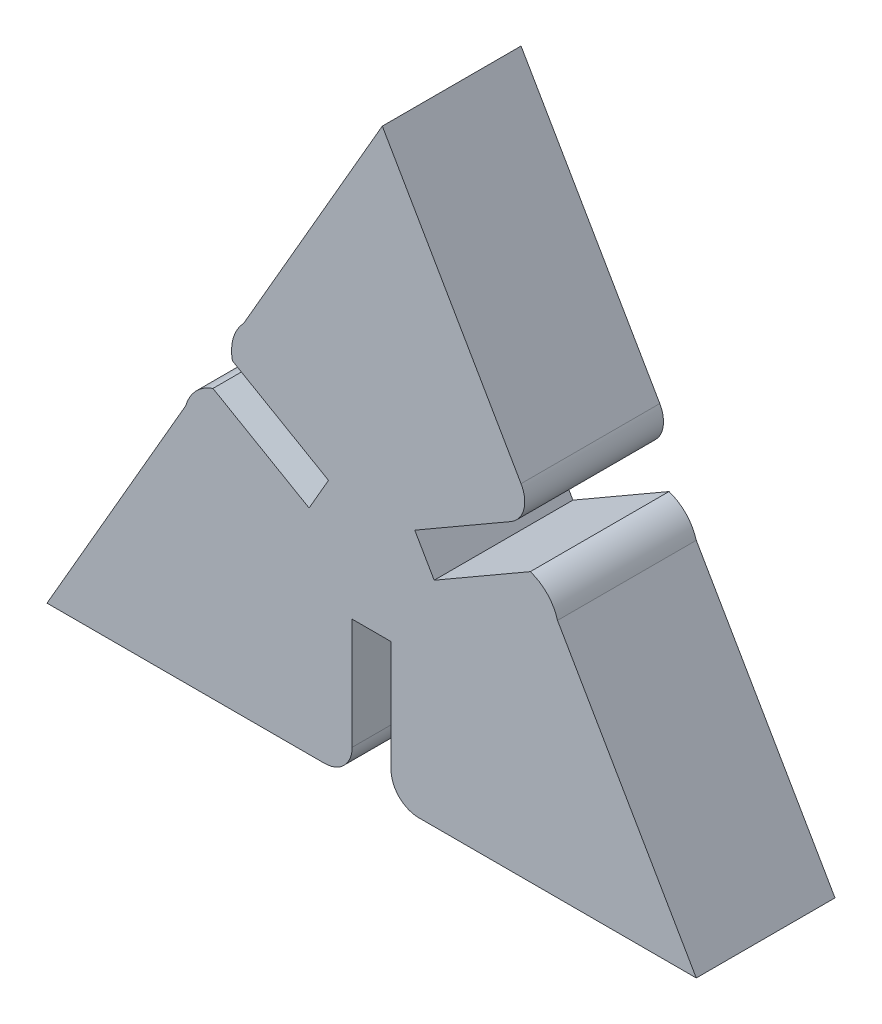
ISO-10303-21;
HEADER;
FILE_DESCRIPTION(('STEP AP214'),'2;1');
FILE_NAME('part.step','',(''),(''),'','','');
FILE_SCHEMA(('AUTOMOTIVE_DESIGN { 1 0 10303 214 1 1 1 1 }'));
ENDSEC;
DATA;
#1=APPLICATION_CONTEXT('core data for automotive mechanical design processes');
#2=APPLICATION_PROTOCOL_DEFINITION('international standard','automotive_design',2000,#1);
#3=PRODUCT_CONTEXT('',#1,'mechanical');
#4=PRODUCT('Part','Part','',(#3));
#5=PRODUCT_RELATED_PRODUCT_CATEGORY('part','',(#4));
#6=PRODUCT_DEFINITION_FORMATION('','',#4);
#7=PRODUCT_DEFINITION_CONTEXT('part definition',#1,'design');
#8=PRODUCT_DEFINITION('design','',#6,#7);
#9=PRODUCT_DEFINITION_SHAPE('','',#8);
#10=(LENGTH_UNIT() NAMED_UNIT(*) SI_UNIT(.MILLI.,.METRE.));
#11=(NAMED_UNIT(*) PLANE_ANGLE_UNIT() SI_UNIT($,.RADIAN.));
#12=(NAMED_UNIT(*) SI_UNIT($,.STERADIAN.) SOLID_ANGLE_UNIT());
#13=UNCERTAINTY_MEASURE_WITH_UNIT(LENGTH_MEASURE(1.E-05),#10,'distance_accuracy_value','');
#14=(GEOMETRIC_REPRESENTATION_CONTEXT(3) GLOBAL_UNCERTAINTY_ASSIGNED_CONTEXT((#13)) GLOBAL_UNIT_ASSIGNED_CONTEXT((#10,
#11,#12)) REPRESENTATION_CONTEXT('',''));
#15=CARTESIAN_POINT('',(0.,0.,0.));
#16=DIRECTION('',(0.,0.,1.));
#17=DIRECTION('',(1.,0.,0.));
#18=AXIS2_PLACEMENT_3D('',#15,#16,#17);
#19=CARTESIAN_POINT('',(-23.4,-26.8655559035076,10.));
#20=DIRECTION('',(0.,1.,0.));
#21=DIRECTION('',(-1.,0.,0.));
#22=AXIS2_PLACEMENT_3D('',#19,#20,#21);
#23=PLANE('',#22);
#24=DIRECTION('',(1.,0.,0.));
#25=VECTOR('',#24,1.);
#26=CARTESIAN_POINT('',(-23.4,-26.8655559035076,0.));
#27=LINE('',#26,#25);
#28=CARTESIAN_POINT('',(-23.4,-26.8655559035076,0.));
#29=VERTEX_POINT('',#28);
#30=CARTESIAN_POINT('',(-3.4,-26.8655559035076,0.));
#31=VERTEX_POINT('',#30);
#32=EDGE_CURVE('E207',#29,#31,#27,.T.);
#33=ORIENTED_EDGE('',*,*,#32,.T.);
#34=DIRECTION('',(0.,0.,-1.));
#35=VECTOR('',#34,1.);
#36=CARTESIAN_POINT('',(-3.4,-26.8655559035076,10.));
#37=LINE('',#36,#35);
#38=CARTESIAN_POINT('',(-3.4,-26.8655559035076,10.));
#39=VERTEX_POINT('',#38);
#40=EDGE_CURVE('E11',#39,#31,#37,.T.);
#41=ORIENTED_EDGE('',*,*,#40,.F.);
#42=DIRECTION('',(1.,0.,0.));
#43=VECTOR('',#42,1.);
#44=CARTESIAN_POINT('',(-23.4,-26.8655559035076,10.));
#45=LINE('',#44,#43);
#46=CARTESIAN_POINT('',(-23.4,-26.8655559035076,10.));
#47=VERTEX_POINT('',#46);
#48=EDGE_CURVE('E247',#47,#39,#45,.T.);
#49=ORIENTED_EDGE('',*,*,#48,.F.);
#50=DIRECTION('',(0.,0.,-1.));
#51=VECTOR('',#50,1.);
#52=CARTESIAN_POINT('',(-23.4,-26.8655559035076,10.));
#53=LINE('',#52,#51);
#54=EDGE_CURVE('E203',#47,#29,#53,.T.);
#55=ORIENTED_EDGE('',*,*,#54,.T.);
#56=EDGE_LOOP('',(#33,#41,#49,#55));
#57=FACE_BOUND('',#56,.T.);
#58=ADVANCED_FACE('F33',(#57),#23,.F.);
#59=CARTESIAN_POINT('',(-3.4,-24.8655559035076,10.));
#60=DIRECTION('',(0.,0.,-1.));
#61=DIRECTION('',(-1.,0.,0.));
#62=AXIS2_PLACEMENT_3D('',#59,#60,#61);
#63=CYLINDRICAL_SURFACE('',#62,2.);
#64=CARTESIAN_POINT('',(-3.4,-24.8655559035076,0.));
#65=DIRECTION('',(0.,0.,1.));
#66=DIRECTION('',(-1.,0.,0.));
#67=AXIS2_PLACEMENT_3D('',#64,#65,#66);
#68=CIRCLE('',#67,2.);
#69=CARTESIAN_POINT('',(-1.4,-24.8655559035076,0.));
#70=VERTEX_POINT('',#69);
#71=EDGE_CURVE('E210',#31,#70,#68,.T.);
#72=ORIENTED_EDGE('',*,*,#71,.T.);
#73=DIRECTION('',(0.,0.,-1.));
#74=VECTOR('',#73,1.);
#75=CARTESIAN_POINT('',(-1.4,-24.8655559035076,10.));
#76=LINE('',#75,#74);
#77=CARTESIAN_POINT('',(-1.4,-24.8655559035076,10.));
#78=VERTEX_POINT('',#77);
#79=EDGE_CURVE('E41',#78,#70,#76,.T.);
#80=ORIENTED_EDGE('',*,*,#79,.F.);
#81=CARTESIAN_POINT('',(-3.4,-24.8655559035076,10.));
#82=DIRECTION('',(0.,0.,1.));
#83=DIRECTION('',(-1.,0.,0.));
#84=AXIS2_PLACEMENT_3D('',#81,#82,#83);
#85=CIRCLE('',#84,2.);
#86=EDGE_CURVE('E131',#39,#78,#85,.T.);
#87=ORIENTED_EDGE('',*,*,#86,.F.);
#88=ORIENTED_EDGE('',*,*,#40,.T.);
#89=EDGE_LOOP('',(#72,#80,#87,#88));
#90=FACE_BOUND('',#89,.T.);
#91=ADVANCED_FACE('F370',(#90),#63,.T.);
#92=CARTESIAN_POINT('',(-1.4,-16.8655559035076,10.));
#93=DIRECTION('',(-1.,0.,0.));
#94=DIRECTION('',(0.,-1.,0.));
#95=AXIS2_PLACEMENT_3D('',#92,#93,#94);
#96=PLANE('',#95);
#97=DIRECTION('',(0.,1.,0.));
#98=VECTOR('',#97,1.);
#99=CARTESIAN_POINT('',(-1.4,-16.8655559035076,0.));
#100=LINE('',#99,#98);
#101=CARTESIAN_POINT('',(-1.4,-16.8655559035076,0.));
#102=VERTEX_POINT('',#101);
#103=EDGE_CURVE('E212',#70,#102,#100,.T.);
#104=ORIENTED_EDGE('',*,*,#103,.T.);
#105=DIRECTION('',(0.,0.,-1.));
#106=VECTOR('',#105,1.);
#107=CARTESIAN_POINT('',(-1.4,-16.8655559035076,10.));
#108=LINE('',#107,#106);
#109=CARTESIAN_POINT('',(-1.4,-16.8655559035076,10.));
#110=VERTEX_POINT('',#109);
#111=EDGE_CURVE('E293',#110,#102,#108,.T.);
#112=ORIENTED_EDGE('',*,*,#111,.F.);
#113=DIRECTION('',(0.,1.,0.));
#114=VECTOR('',#113,1.);
#115=CARTESIAN_POINT('',(-1.4,-16.8655559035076,10.));
#116=LINE('',#115,#114);
#117=EDGE_CURVE('E301',#78,#110,#116,.T.);
#118=ORIENTED_EDGE('',*,*,#117,.F.);
#119=ORIENTED_EDGE('',*,*,#79,.T.);
#120=EDGE_LOOP('',(#104,#112,#118,#119));
#121=FACE_BOUND('',#120,.T.);
#122=ADVANCED_FACE('F299',(#121),#96,.F.);
#123=CARTESIAN_POINT('',(-1.4,-16.8655559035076,10.));
#124=DIRECTION('',(0.,1.,0.));
#125=DIRECTION('',(0.,0.,1.));
#126=AXIS2_PLACEMENT_3D('',#123,#124,#125);
#127=PLANE('',#126);
#128=DIRECTION('',(1.,0.,0.));
#129=VECTOR('',#128,1.);
#130=CARTESIAN_POINT('',(-1.4,-16.8655559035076,0.));
#131=LINE('',#130,#129);
#132=CARTESIAN_POINT('',(1.4,-16.8655559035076,0.));
#133=VERTEX_POINT('',#132);
#134=EDGE_CURVE('E214',#102,#133,#131,.T.);
#135=ORIENTED_EDGE('',*,*,#134,.T.);
#136=DIRECTION('',(0.,0.,-1.));
#137=VECTOR('',#136,1.);
#138=CARTESIAN_POINT('',(1.4,-16.8655559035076,10.));
#139=LINE('',#138,#137);
#140=CARTESIAN_POINT('',(1.4,-16.8655559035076,10.));
#141=VERTEX_POINT('',#140);
#142=EDGE_CURVE('E290',#141,#133,#139,.T.);
#143=ORIENTED_EDGE('',*,*,#142,.F.);
#144=DIRECTION('',(1.,0.,0.));
#145=VECTOR('',#144,1.);
#146=CARTESIAN_POINT('',(-1.4,-16.8655559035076,10.));
#147=LINE('',#146,#145);
#148=EDGE_CURVE('E319',#110,#141,#147,.T.);
#149=ORIENTED_EDGE('',*,*,#148,.F.);
#150=ORIENTED_EDGE('',*,*,#111,.T.);
#151=EDGE_LOOP('',(#135,#143,#149,#150));
#152=FACE_BOUND('',#151,.T.);
#153=ADVANCED_FACE('F310',(#152),#127,.F.);
#154=CARTESIAN_POINT('',(1.4,-16.8655559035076,10.));
#155=DIRECTION('',(1.,0.,0.));
#156=DIRECTION('',(0.,1.,0.));
#157=AXIS2_PLACEMENT_3D('',#154,#155,#156);
#158=PLANE('',#157);
#159=DIRECTION('',(0.,-1.,0.));
#160=VECTOR('',#159,1.);
#161=CARTESIAN_POINT('',(1.4,-16.8655559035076,0.));
#162=LINE('',#161,#160);
#163=CARTESIAN_POINT('',(1.4,-24.8655559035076,0.));
#164=VERTEX_POINT('',#163);
#165=EDGE_CURVE('E216',#133,#164,#162,.T.);
#166=ORIENTED_EDGE('',*,*,#165,.T.);
#167=DIRECTION('',(0.,0.,-1.));
#168=VECTOR('',#167,1.);
#169=CARTESIAN_POINT('',(1.4,-24.8655559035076,10.));
#170=LINE('',#169,#168);
#171=CARTESIAN_POINT('',(1.4,-24.8655559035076,10.));
#172=VERTEX_POINT('',#171);
#173=EDGE_CURVE('E287',#172,#164,#170,.T.);
#174=ORIENTED_EDGE('',*,*,#173,.F.);
#175=DIRECTION('',(0.,-1.,0.));
#176=VECTOR('',#175,1.);
#177=CARTESIAN_POINT('',(1.4,-16.8655559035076,10.));
#178=LINE('',#177,#176);
#179=EDGE_CURVE('E316',#141,#172,#178,.T.);
#180=ORIENTED_EDGE('',*,*,#179,.F.);
#181=ORIENTED_EDGE('',*,*,#142,.T.);
#182=EDGE_LOOP('',(#166,#174,#180,#181));
#183=FACE_BOUND('',#182,.T.);
#184=ADVANCED_FACE('F314',(#183),#158,.F.);
#185=CARTESIAN_POINT('',(3.4,-24.8655559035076,10.));
#186=DIRECTION('',(0.,0.,-1.));
#187=DIRECTION('',(-1.,0.,0.));
#188=AXIS2_PLACEMENT_3D('',#185,#186,#187);
#189=CYLINDRICAL_SURFACE('',#188,2.);
#190=CARTESIAN_POINT('',(3.4,-24.8655559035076,0.));
#191=DIRECTION('',(0.,0.,1.));
#192=DIRECTION('',(1.,0.,0.));
#193=AXIS2_PLACEMENT_3D('',#190,#191,#192);
#194=CIRCLE('',#193,2.);
#195=CARTESIAN_POINT('',(3.4,-26.8655559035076,0.));
#196=VERTEX_POINT('',#195);
#197=EDGE_CURVE('E218',#164,#196,#194,.T.);
#198=ORIENTED_EDGE('',*,*,#197,.T.);
#199=DIRECTION('',(0.,0.,-1.));
#200=VECTOR('',#199,1.);
#201=CARTESIAN_POINT('',(3.4,-26.8655559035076,10.));
#202=LINE('',#201,#200);
#203=CARTESIAN_POINT('',(3.4,-26.8655559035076,10.));
#204=VERTEX_POINT('',#203);
#205=EDGE_CURVE('E284',#204,#196,#202,.T.);
#206=ORIENTED_EDGE('',*,*,#205,.F.);
#207=CARTESIAN_POINT('',(3.4,-24.8655559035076,10.));
#208=DIRECTION('',(0.,0.,1.));
#209=DIRECTION('',(1.,0.,0.));
#210=AXIS2_PLACEMENT_3D('',#207,#208,#209);
#211=CIRCLE('',#210,2.);
#212=EDGE_CURVE('E318',#172,#204,#211,.T.);
#213=ORIENTED_EDGE('',*,*,#212,.F.);
#214=ORIENTED_EDGE('',*,*,#173,.T.);
#215=EDGE_LOOP('',(#198,#206,#213,#214));
#216=FACE_BOUND('',#215,.T.);
#217=ADVANCED_FACE('F383',(#216),#189,.T.);
#218=CARTESIAN_POINT('',(23.4,-26.8655559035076,10.));
#219=DIRECTION('',(0.,1.,0.));
#220=DIRECTION('',(-1.,0.,0.));
#221=AXIS2_PLACEMENT_3D('',#218,#219,#220);
#222=PLANE('',#221);
#223=DIRECTION('',(1.,0.,0.));
#224=VECTOR('',#223,1.);
#225=CARTESIAN_POINT('',(23.4,-26.8655559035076,0.));
#226=LINE('',#225,#224);
#227=CARTESIAN_POINT('',(23.4,-26.8655559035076,0.));
#228=VERTEX_POINT('',#227);
#229=EDGE_CURVE('E220',#196,#228,#226,.T.);
#230=ORIENTED_EDGE('',*,*,#229,.T.);
#231=DIRECTION('',(0.,0.,-1.));
#232=VECTOR('',#231,1.);
#233=CARTESIAN_POINT('',(23.4,-26.8655559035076,10.));
#234=LINE('',#233,#232);
#235=CARTESIAN_POINT('',(23.4,-26.8655559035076,10.));
#236=VERTEX_POINT('',#235);
#237=EDGE_CURVE('E281',#236,#228,#234,.T.);
#238=ORIENTED_EDGE('',*,*,#237,.F.);
#239=DIRECTION('',(1.,0.,0.));
#240=VECTOR('',#239,1.);
#241=CARTESIAN_POINT('',(23.4,-26.8655559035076,10.));
#242=LINE('',#241,#240);
#243=EDGE_CURVE('E321',#204,#236,#242,.T.);
#244=ORIENTED_EDGE('',*,*,#243,.F.);
#245=ORIENTED_EDGE('',*,*,#205,.T.);
#246=EDGE_LOOP('',(#230,#238,#244,#245));
#247=FACE_BOUND('',#246,.T.);
#248=ADVANCED_FACE('F386',(#247),#222,.F.);
#249=CARTESIAN_POINT('',(13.4,-9.54504782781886,10.));
#250=DIRECTION('',(-0.866025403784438,-0.5,0.));
#251=DIRECTION('',(0.5,-0.866025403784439,0.));
#252=AXIS2_PLACEMENT_3D('',#249,#250,#251);
#253=PLANE('',#252);
#254=DIRECTION('',(-0.5,0.866025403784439,0.));
#255=VECTOR('',#254,1.);
#256=CARTESIAN_POINT('',(13.4,-9.54504782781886,0.));
#257=LINE('',#256,#255);
#258=CARTESIAN_POINT('',(13.4,-9.54504782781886,0.));
#259=VERTEX_POINT('',#258);
#260=EDGE_CURVE('E222',#228,#259,#257,.T.);
#261=ORIENTED_EDGE('',*,*,#260,.T.);
#262=DIRECTION('',(0.,0.,-1.));
#263=VECTOR('',#262,1.);
#264=CARTESIAN_POINT('',(13.4,-9.54504782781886,10.));
#265=LINE('',#264,#263);
#266=CARTESIAN_POINT('',(13.4,-9.54504782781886,10.));
#267=VERTEX_POINT('',#266);
#268=EDGE_CURVE('E278',#267,#259,#265,.T.);
#269=ORIENTED_EDGE('',*,*,#268,.F.);
#270=DIRECTION('',(-0.5,0.866025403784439,0.));
#271=VECTOR('',#270,1.);
#272=CARTESIAN_POINT('',(13.4,-9.54504782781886,10.));
#273=LINE('',#272,#271);
#274=EDGE_CURVE('E327',#236,#267,#273,.T.);
#275=ORIENTED_EDGE('',*,*,#274,.F.);
#276=ORIENTED_EDGE('',*,*,#237,.T.);
#277=EDGE_LOOP('',(#261,#269,#275,#276));
#278=FACE_BOUND('',#277,.T.);
#279=ADVANCED_FACE('F390',(#278),#253,.F.);
#280=CARTESIAN_POINT('',(10.4650581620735,-10.3698408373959,10.));
#281=DIRECTION('',(0.,0.,-1.));
#282=DIRECTION('',(-1.,0.,0.));
#283=AXIS2_PLACEMENT_3D('',#280,#281,#282);
#284=CYLINDRICAL_SURFACE('',#283,3.04863364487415);
#285=CARTESIAN_POINT('',(10.4650581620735,-10.3698408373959,0.));
#286=DIRECTION('',(0.,0.,1.));
#287=DIRECTION('',(1.,0.,0.));
#288=AXIS2_PLACEMENT_3D('',#285,#286,#287);
#289=CIRCLE('',#288,3.04863364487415);
#290=CARTESIAN_POINT('',(11.4373241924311,-7.48040043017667,0.));
#291=VERTEX_POINT('',#290);
#292=EDGE_CURVE('E224',#259,#291,#289,.T.);
#293=ORIENTED_EDGE('',*,*,#292,.T.);
#294=DIRECTION('',(0.,0.,-1.));
#295=VECTOR('',#294,1.);
#296=CARTESIAN_POINT('',(11.4373241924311,-7.48040043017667,10.));
#297=LINE('',#296,#295);
#298=CARTESIAN_POINT('',(11.4373241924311,-7.48040043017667,10.));
#299=VERTEX_POINT('',#298);
#300=EDGE_CURVE('E275',#299,#291,#297,.T.);
#301=ORIENTED_EDGE('',*,*,#300,.F.);
#302=CARTESIAN_POINT('',(10.4650581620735,-10.3698408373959,10.));
#303=DIRECTION('',(0.,0.,1.));
#304=DIRECTION('',(1.,0.,0.));
#305=AXIS2_PLACEMENT_3D('',#302,#303,#304);
#306=CIRCLE('',#305,3.04863364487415);
#307=EDGE_CURVE('E329',#267,#299,#306,.T.);
#308=ORIENTED_EDGE('',*,*,#307,.F.);
#309=ORIENTED_EDGE('',*,*,#268,.T.);
#310=EDGE_LOOP('',(#293,#301,#308,#309));
#311=FACE_BOUND('',#310,.T.);
#312=ADVANCED_FACE('F394',(#311),#284,.T.);
#313=CARTESIAN_POINT('',(4.50912096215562,-11.4804004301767,10.));
#314=DIRECTION('',(0.5,-0.866025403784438,0.));
#315=DIRECTION('',(0.866025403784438,0.5,0.));
#316=AXIS2_PLACEMENT_3D('',#313,#314,#315);
#317=PLANE('',#316);
#318=DIRECTION('',(-0.866025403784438,-0.5,0.));
#319=VECTOR('',#318,1.);
#320=CARTESIAN_POINT('',(4.50912096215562,-11.4804004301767,0.));
#321=LINE('',#320,#319);
#322=CARTESIAN_POINT('',(4.50912096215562,-11.4804004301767,0.));
#323=VERTEX_POINT('',#322);
#324=EDGE_CURVE('E226',#291,#323,#321,.T.);
#325=ORIENTED_EDGE('',*,*,#324,.T.);
#326=DIRECTION('',(0.,0.,-1.));
#327=VECTOR('',#326,1.);
#328=CARTESIAN_POINT('',(4.50912096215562,-11.4804004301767,10.));
#329=LINE('',#328,#327);
#330=CARTESIAN_POINT('',(4.50912096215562,-11.4804004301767,10.));
#331=VERTEX_POINT('',#330);
#332=EDGE_CURVE('E272',#331,#323,#329,.T.);
#333=ORIENTED_EDGE('',*,*,#332,.F.);
#334=DIRECTION('',(-0.866025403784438,-0.5,0.));
#335=VECTOR('',#334,1.);
#336=CARTESIAN_POINT('',(4.50912096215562,-11.4804004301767,10.));
#337=LINE('',#336,#335);
#338=EDGE_CURVE('E331',#299,#331,#337,.T.);
#339=ORIENTED_EDGE('',*,*,#338,.F.);
#340=ORIENTED_EDGE('',*,*,#300,.T.);
#341=EDGE_LOOP('',(#325,#333,#339,#340));
#342=FACE_BOUND('',#341,.T.);
#343=ADVANCED_FACE('F398',(#342),#317,.F.);
#344=CARTESIAN_POINT('',(4.50912096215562,-11.4804004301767,10.));
#345=DIRECTION('',(-0.866025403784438,-0.5,0.));
#346=DIRECTION('',(0.5,-0.866025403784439,0.));
#347=AXIS2_PLACEMENT_3D('',#344,#345,#346);
#348=PLANE('',#347);
#349=DIRECTION('',(-0.5,0.866025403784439,0.));
#350=VECTOR('',#349,1.);
#351=CARTESIAN_POINT('',(4.50912096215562,-11.4804004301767,0.));
#352=LINE('',#351,#350);
#353=CARTESIAN_POINT('',(3.10912096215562,-9.05552929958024,0.));
#354=VERTEX_POINT('',#353);
#355=EDGE_CURVE('E228',#323,#354,#352,.T.);
#356=ORIENTED_EDGE('',*,*,#355,.T.);
#357=DIRECTION('',(0.,0.,-1.));
#358=VECTOR('',#357,1.);
#359=CARTESIAN_POINT('',(3.10912096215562,-9.05552929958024,10.));
#360=LINE('',#359,#358);
#361=CARTESIAN_POINT('',(3.10912096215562,-9.05552929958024,10.));
#362=VERTEX_POINT('',#361);
#363=EDGE_CURVE('E269',#362,#354,#360,.T.);
#364=ORIENTED_EDGE('',*,*,#363,.F.);
#365=DIRECTION('',(-0.5,0.866025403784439,0.));
#366=VECTOR('',#365,1.);
#367=CARTESIAN_POINT('',(4.50912096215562,-11.4804004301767,10.));
#368=LINE('',#367,#366);
#369=EDGE_CURVE('E333',#331,#362,#368,.T.);
#370=ORIENTED_EDGE('',*,*,#369,.F.);
#371=ORIENTED_EDGE('',*,*,#332,.T.);
#372=EDGE_LOOP('',(#356,#364,#370,#371));
#373=FACE_BOUND('',#372,.T.);
#374=ADVANCED_FACE('F402',(#373),#348,.F.);
#375=CARTESIAN_POINT('',(3.10912096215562,-9.05552929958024,10.));
#376=DIRECTION('',(-0.5,0.866025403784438,0.));
#377=DIRECTION('',(-0.866025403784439,-0.5,0.));
#378=AXIS2_PLACEMENT_3D('',#375,#376,#377);
#379=PLANE('',#378);
#380=DIRECTION('',(0.866025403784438,0.5,0.));
#381=VECTOR('',#380,1.);
#382=CARTESIAN_POINT('',(3.10912096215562,-9.05552929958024,0.));
#383=LINE('',#382,#381);
#384=CARTESIAN_POINT('',(10.0373241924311,-5.05552929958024,0.));
#385=VERTEX_POINT('',#384);
#386=EDGE_CURVE('E230',#354,#385,#383,.T.);
#387=ORIENTED_EDGE('',*,*,#386,.T.);
#388=DIRECTION('',(0.,0.,-1.));
#389=VECTOR('',#388,1.);
#390=CARTESIAN_POINT('',(10.0373241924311,-5.05552929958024,10.));
#391=LINE('',#390,#389);
#392=CARTESIAN_POINT('',(10.0373241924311,-5.05552929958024,10.));
#393=VERTEX_POINT('',#392);
#394=EDGE_CURVE('E266',#393,#385,#391,.T.);
#395=ORIENTED_EDGE('',*,*,#394,.F.);
#396=DIRECTION('',(0.866025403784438,0.5,0.));
#397=VECTOR('',#396,1.);
#398=CARTESIAN_POINT('',(3.10912096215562,-9.05552929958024,10.));
#399=LINE('',#398,#397);
#400=EDGE_CURVE('E335',#362,#393,#399,.T.);
#401=ORIENTED_EDGE('',*,*,#400,.F.);
#402=ORIENTED_EDGE('',*,*,#363,.T.);
#403=EDGE_LOOP('',(#387,#395,#401,#402));
#404=FACE_BOUND('',#403,.T.);
#405=ADVANCED_FACE('F406',(#404),#379,.F.);
#406=CARTESIAN_POINT('',(9.03732419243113,-3.32347849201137,10.));
#407=DIRECTION('',(0.,0.,-1.));
#408=DIRECTION('',(-1.,0.,0.));
#409=AXIS2_PLACEMENT_3D('',#406,#407,#408);
#410=CYLINDRICAL_SURFACE('',#409,2.);
#411=CARTESIAN_POINT('',(9.03732419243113,-3.32347849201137,0.));
#412=DIRECTION('',(0.,0.,1.));
#413=DIRECTION('',(1.,0.,0.));
#414=AXIS2_PLACEMENT_3D('',#411,#412,#413);
#415=CIRCLE('',#414,2.);
#416=CARTESIAN_POINT('',(10.769375,-2.32347849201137,0.));
#417=VERTEX_POINT('',#416);
#418=EDGE_CURVE('E232',#385,#417,#415,.T.);
#419=ORIENTED_EDGE('',*,*,#418,.T.);
#420=DIRECTION('',(0.,0.,-1.));
#421=VECTOR('',#420,1.);
#422=CARTESIAN_POINT('',(10.769375,-2.32347849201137,10.));
#423=LINE('',#422,#421);
#424=CARTESIAN_POINT('',(10.769375,-2.32347849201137,10.));
#425=VERTEX_POINT('',#424);
#426=EDGE_CURVE('E263',#425,#417,#423,.T.);
#427=ORIENTED_EDGE('',*,*,#426,.F.);
#428=CARTESIAN_POINT('',(9.03732419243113,-3.32347849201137,10.));
#429=DIRECTION('',(0.,0.,1.));
#430=DIRECTION('',(1.,0.,0.));
#431=AXIS2_PLACEMENT_3D('',#428,#429,#430);
#432=CIRCLE('',#431,2.);
#433=EDGE_CURVE('E337',#393,#425,#432,.T.);
#434=ORIENTED_EDGE('',*,*,#433,.F.);
#435=ORIENTED_EDGE('',*,*,#394,.T.);
#436=EDGE_LOOP('',(#419,#427,#434,#435));
#437=FACE_BOUND('',#436,.T.);
#438=ADVANCED_FACE('F410',(#437),#410,.T.);
#439=CARTESIAN_POINT('',(0.769374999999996,14.9970295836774,10.));
#440=DIRECTION('',(-0.866025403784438,-0.500000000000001,0.));
#441=DIRECTION('',(0.500000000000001,-0.866025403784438,0.));
#442=AXIS2_PLACEMENT_3D('',#439,#440,#441);
#443=PLANE('',#442);
#444=DIRECTION('',(-0.500000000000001,0.866025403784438,0.));
#445=VECTOR('',#444,1.);
#446=CARTESIAN_POINT('',(0.769374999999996,14.9970295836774,0.));
#447=LINE('',#446,#445);
#448=CARTESIAN_POINT('',(0.769374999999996,14.9970295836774,0.));
#449=VERTEX_POINT('',#448);
#450=EDGE_CURVE('E234',#417,#449,#447,.T.);
#451=ORIENTED_EDGE('',*,*,#450,.T.);
#452=DIRECTION('',(0.,0.,-1.));
#453=VECTOR('',#452,1.);
#454=CARTESIAN_POINT('',(0.769374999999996,14.9970295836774,10.));
#455=LINE('',#454,#453);
#456=CARTESIAN_POINT('',(0.769374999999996,14.9970295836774,10.));
#457=VERTEX_POINT('',#456);
#458=EDGE_CURVE('E260',#457,#449,#455,.T.);
#459=ORIENTED_EDGE('',*,*,#458,.F.);
#460=DIRECTION('',(-0.500000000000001,0.866025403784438,0.));
#461=VECTOR('',#460,1.);
#462=CARTESIAN_POINT('',(0.769374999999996,14.9970295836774,10.));
#463=LINE('',#462,#461);
#464=EDGE_CURVE('E339',#425,#457,#463,.T.);
#465=ORIENTED_EDGE('',*,*,#464,.F.);
#466=ORIENTED_EDGE('',*,*,#426,.T.);
#467=EDGE_LOOP('',(#451,#459,#465,#466));
#468=FACE_BOUND('',#467,.T.);
#469=ADVANCED_FACE('F414',(#468),#443,.F.);
#470=CARTESIAN_POINT('',(-9.23062499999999,-2.32347849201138,10.));
#471=DIRECTION('',(0.866025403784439,-0.5,0.));
#472=DIRECTION('',(0.5,0.866025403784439,0.));
#473=AXIS2_PLACEMENT_3D('',#470,#471,#472);
#474=PLANE('',#473);
#475=DIRECTION('',(-0.5,-0.866025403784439,0.));
#476=VECTOR('',#475,1.);
#477=CARTESIAN_POINT('',(-9.23062499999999,-2.32347849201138,0.));
#478=LINE('',#477,#476);
#479=CARTESIAN_POINT('',(-9.23062499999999,-2.32347849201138,0.));
#480=VERTEX_POINT('',#479);
#481=EDGE_CURVE('E236',#449,#480,#478,.T.);
#482=ORIENTED_EDGE('',*,*,#481,.T.);
#483=DIRECTION('',(0.,0.,-1.));
#484=VECTOR('',#483,1.);
#485=CARTESIAN_POINT('',(-9.23062499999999,-2.32347849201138,10.));
#486=LINE('',#485,#484);
#487=CARTESIAN_POINT('',(-9.23062499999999,-2.32347849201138,10.));
#488=VERTEX_POINT('',#487);
#489=EDGE_CURVE('E257',#488,#480,#486,.T.);
#490=ORIENTED_EDGE('',*,*,#489,.F.);
#491=DIRECTION('',(-0.5,-0.866025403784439,0.));
#492=VECTOR('',#491,1.);
#493=CARTESIAN_POINT('',(-9.23062499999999,-2.32347849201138,10.));
#494=LINE('',#493,#492);
#495=EDGE_CURVE('E341',#457,#488,#494,.T.);
#496=ORIENTED_EDGE('',*,*,#495,.F.);
#497=ORIENTED_EDGE('',*,*,#458,.T.);
#498=EDGE_LOOP('',(#482,#490,#496,#497));
#499=FACE_BOUND('',#498,.T.);
#500=ADVANCED_FACE('F418',(#499),#474,.F.);
#501=CARTESIAN_POINT('',(-7.0488623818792,-4.45281617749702,10.));
#502=DIRECTION('',(0.,0.,-1.));
#503=DIRECTION('',(-1.,0.,0.));
#504=AXIS2_PLACEMENT_3D('',#501,#502,#503);
#505=CYLINDRICAL_SURFACE('',#504,3.04863364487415);
#506=CARTESIAN_POINT('',(-7.0488623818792,-4.45281617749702,0.));
#507=DIRECTION('',(0.,0.,1.));
#508=DIRECTION('',(1.,0.,0.));
#509=AXIS2_PLACEMENT_3D('',#506,#507,#508);
#510=CIRCLE('',#509,3.04863364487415);
#511=CARTESIAN_POINT('',(-10.0373241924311,-5.05552929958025,0.));
#512=VERTEX_POINT('',#511);
#513=EDGE_CURVE('E238',#480,#512,#510,.T.);
#514=ORIENTED_EDGE('',*,*,#513,.T.);
#515=DIRECTION('',(0.,0.,-1.));
#516=VECTOR('',#515,1.);
#517=CARTESIAN_POINT('',(-10.0373241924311,-5.05552929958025,10.));
#518=LINE('',#517,#516);
#519=CARTESIAN_POINT('',(-10.0373241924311,-5.05552929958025,10.));
#520=VERTEX_POINT('',#519);
#521=EDGE_CURVE('E254',#520,#512,#518,.T.);
#522=ORIENTED_EDGE('',*,*,#521,.F.);
#523=CARTESIAN_POINT('',(-7.0488623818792,-4.45281617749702,10.));
#524=DIRECTION('',(0.,0.,1.));
#525=DIRECTION('',(1.,0.,0.));
#526=AXIS2_PLACEMENT_3D('',#523,#524,#525);
#527=CIRCLE('',#526,3.04863364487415);
#528=EDGE_CURVE('E343',#488,#520,#527,.T.);
#529=ORIENTED_EDGE('',*,*,#528,.F.);
#530=ORIENTED_EDGE('',*,*,#489,.T.);
#531=EDGE_LOOP('',(#514,#522,#529,#530));
#532=FACE_BOUND('',#531,.T.);
#533=ADVANCED_FACE('F422',(#532),#505,.T.);
#534=CARTESIAN_POINT('',(-3.10912096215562,-9.05552929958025,10.));
#535=DIRECTION('',(0.5,0.866025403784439,0.));
#536=DIRECTION('',(-0.866025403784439,0.5,0.));
#537=AXIS2_PLACEMENT_3D('',#534,#535,#536);
#538=PLANE('',#537);
#539=DIRECTION('',(0.866025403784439,-0.5,0.));
#540=VECTOR('',#539,1.);
#541=CARTESIAN_POINT('',(-3.10912096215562,-9.05552929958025,0.));
#542=LINE('',#541,#540);
#543=CARTESIAN_POINT('',(-3.10912096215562,-9.05552929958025,0.));
#544=VERTEX_POINT('',#543);
#545=EDGE_CURVE('E240',#512,#544,#542,.T.);
#546=ORIENTED_EDGE('',*,*,#545,.T.);
#547=DIRECTION('',(0.,0.,-1.));
#548=VECTOR('',#547,1.);
#549=CARTESIAN_POINT('',(-3.10912096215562,-9.05552929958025,10.));
#550=LINE('',#549,#548);
#551=CARTESIAN_POINT('',(-3.10912096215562,-9.05552929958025,10.));
#552=VERTEX_POINT('',#551);
#553=EDGE_CURVE('E251',#552,#544,#550,.T.);
#554=ORIENTED_EDGE('',*,*,#553,.F.);
#555=DIRECTION('',(0.866025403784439,-0.5,0.));
#556=VECTOR('',#555,1.);
#557=CARTESIAN_POINT('',(-3.10912096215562,-9.05552929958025,10.));
#558=LINE('',#557,#556);
#559=EDGE_CURVE('E345',#520,#552,#558,.T.);
#560=ORIENTED_EDGE('',*,*,#559,.F.);
#561=ORIENTED_EDGE('',*,*,#521,.T.);
#562=EDGE_LOOP('',(#546,#554,#560,#561));
#563=FACE_BOUND('',#562,.T.);
#564=ADVANCED_FACE('F351',(#563),#538,.F.);
#565=CARTESIAN_POINT('',(-4.50912096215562,-11.4804004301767,10.));
#566=DIRECTION('',(0.866025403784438,-0.500000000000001,0.));
#567=DIRECTION('',(0.500000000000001,0.866025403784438,0.));
#568=AXIS2_PLACEMENT_3D('',#565,#566,#567);
#569=PLANE('',#568);
#570=DIRECTION('',(-0.500000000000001,-0.866025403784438,0.));
#571=VECTOR('',#570,1.);
#572=CARTESIAN_POINT('',(-4.50912096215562,-11.4804004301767,0.));
#573=LINE('',#572,#571);
#574=CARTESIAN_POINT('',(-4.50912096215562,-11.4804004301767,0.));
#575=VERTEX_POINT('',#574);
#576=EDGE_CURVE('E242',#544,#575,#573,.T.);
#577=ORIENTED_EDGE('',*,*,#576,.T.);
#578=DIRECTION('',(0.,0.,-1.));
#579=VECTOR('',#578,1.);
#580=CARTESIAN_POINT('',(-4.50912096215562,-11.4804004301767,10.));
#581=LINE('',#580,#579);
#582=CARTESIAN_POINT('',(-4.50912096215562,-11.4804004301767,10.));
#583=VERTEX_POINT('',#582);
#584=EDGE_CURVE('E198',#583,#575,#581,.T.);
#585=ORIENTED_EDGE('',*,*,#584,.F.);
#586=DIRECTION('',(-0.500000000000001,-0.866025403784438,0.));
#587=VECTOR('',#586,1.);
#588=CARTESIAN_POINT('',(-4.50912096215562,-11.4804004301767,10.));
#589=LINE('',#588,#587);
#590=EDGE_CURVE('E189',#552,#583,#589,.T.);
#591=ORIENTED_EDGE('',*,*,#590,.F.);
#592=ORIENTED_EDGE('',*,*,#553,.T.);
#593=EDGE_LOOP('',(#577,#585,#591,#592));
#594=FACE_BOUND('',#593,.T.);
#595=ADVANCED_FACE('F355',(#594),#569,.F.);
#596=CARTESIAN_POINT('',(-4.50912096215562,-11.4804004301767,10.));
#597=DIRECTION('',(-0.5,-0.866025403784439,0.));
#598=DIRECTION('',(0.866025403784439,-0.5,0.));
#599=AXIS2_PLACEMENT_3D('',#596,#597,#598);
#600=PLANE('',#599);
#601=DIRECTION('',(-0.866025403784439,0.5,0.));
#602=VECTOR('',#601,1.);
#603=CARTESIAN_POINT('',(-4.50912096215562,-11.4804004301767,0.));
#604=LINE('',#603,#602);
#605=CARTESIAN_POINT('',(-11.4373241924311,-7.48040043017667,0.));
#606=VERTEX_POINT('',#605);
#607=EDGE_CURVE('E197',#575,#606,#604,.T.);
#608=ORIENTED_EDGE('',*,*,#607,.T.);
#609=DIRECTION('',(0.,0.,-1.));
#610=VECTOR('',#609,1.);
#611=CARTESIAN_POINT('',(-11.4373241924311,-7.48040043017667,10.));
#612=LINE('',#611,#610);
#613=CARTESIAN_POINT('',(-11.4373241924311,-7.48040043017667,10.));
#614=VERTEX_POINT('',#613);
#615=EDGE_CURVE('E194',#614,#606,#612,.T.);
#616=ORIENTED_EDGE('',*,*,#615,.F.);
#617=DIRECTION('',(-0.866025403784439,0.5,0.));
#618=VECTOR('',#617,1.);
#619=CARTESIAN_POINT('',(-4.50912096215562,-11.4804004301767,10.));
#620=LINE('',#619,#618);
#621=EDGE_CURVE('E183',#583,#614,#620,.T.);
#622=ORIENTED_EDGE('',*,*,#621,.F.);
#623=ORIENTED_EDGE('',*,*,#584,.T.);
#624=EDGE_LOOP('',(#608,#616,#622,#623));
#625=FACE_BOUND('',#624,.T.);
#626=ADVANCED_FACE('F195',(#625),#600,.F.);
#627=CARTESIAN_POINT('',(-10.4650581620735,-10.3698408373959,10.));
#628=DIRECTION('',(0.,0.,-1.));
#629=DIRECTION('',(-1.,0.,0.));
#630=AXIS2_PLACEMENT_3D('',#627,#628,#629);
#631=CYLINDRICAL_SURFACE('',#630,3.04863364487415);
#632=CARTESIAN_POINT('',(-10.4650581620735,-10.3698408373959,0.));
#633=DIRECTION('',(0.,0.,1.));
#634=DIRECTION('',(-1.,0.,0.));
#635=AXIS2_PLACEMENT_3D('',#632,#633,#634);
#636=CIRCLE('',#635,3.04863364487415);
#637=CARTESIAN_POINT('',(-13.4,-9.54504782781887,0.));
#638=VERTEX_POINT('',#637);
#639=EDGE_CURVE('E117',#606,#638,#636,.T.);
#640=ORIENTED_EDGE('',*,*,#639,.T.);
#641=DIRECTION('',(0.,0.,-1.));
#642=VECTOR('',#641,1.);
#643=CARTESIAN_POINT('',(-13.4,-9.54504782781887,10.));
#644=LINE('',#643,#642);
#645=CARTESIAN_POINT('',(-13.4,-9.54504782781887,10.));
#646=VERTEX_POINT('',#645);
#647=EDGE_CURVE('E199',#646,#638,#644,.T.);
#648=ORIENTED_EDGE('',*,*,#647,.F.);
#649=CARTESIAN_POINT('',(-10.4650581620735,-10.3698408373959,10.));
#650=DIRECTION('',(0.,0.,1.));
#651=DIRECTION('',(-1.,0.,0.));
#652=AXIS2_PLACEMENT_3D('',#649,#650,#651);
#653=CIRCLE('',#652,3.04863364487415);
#654=EDGE_CURVE('E187',#614,#646,#653,.T.);
#655=ORIENTED_EDGE('',*,*,#654,.F.);
#656=ORIENTED_EDGE('',*,*,#615,.T.);
#657=EDGE_LOOP('',(#640,#648,#655,#656));
#658=FACE_BOUND('',#657,.T.);
#659=ADVANCED_FACE('F201',(#658),#631,.T.);
#660=CARTESIAN_POINT('',(-13.4,-9.54504782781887,10.));
#661=DIRECTION('',(0.866025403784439,-0.5,0.));
#662=DIRECTION('',(0.5,0.866025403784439,0.));
#663=AXIS2_PLACEMENT_3D('',#660,#661,#662);
#664=PLANE('',#663);
#665=DIRECTION('',(-0.5,-0.866025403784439,0.));
#666=VECTOR('',#665,1.);
#667=CARTESIAN_POINT('',(-13.4,-9.54504782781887,0.));
#668=LINE('',#667,#666);
#669=EDGE_CURVE('E123',#638,#29,#668,.T.);
#670=ORIENTED_EDGE('',*,*,#669,.T.);
#671=ORIENTED_EDGE('',*,*,#54,.F.);
#672=DIRECTION('',(-0.5,-0.866025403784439,0.));
#673=VECTOR('',#672,1.);
#674=CARTESIAN_POINT('',(-13.4,-9.54504782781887,10.));
#675=LINE('',#674,#673);
#676=EDGE_CURVE('E49',#646,#47,#675,.T.);
#677=ORIENTED_EDGE('',*,*,#676,.F.);
#678=ORIENTED_EDGE('',*,*,#647,.T.);
#679=EDGE_LOOP('',(#670,#671,#677,#678));
#680=FACE_BOUND('',#679,.T.);
#681=ADVANCED_FACE('F359',(#680),#664,.F.);
#682=CARTESIAN_POINT('',(-3.4,-24.8655559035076,10.));
#683=DIRECTION('',(0.,0.,-1.));
#684=DIRECTION('',(-1.,0.,0.));
#685=AXIS2_PLACEMENT_3D('',#682,#683,#684);
#686=PLANE('',#685);
#687=ORIENTED_EDGE('',*,*,#48,.T.);
#688=ORIENTED_EDGE('',*,*,#86,.T.);
#689=ORIENTED_EDGE('',*,*,#117,.T.);
#690=ORIENTED_EDGE('',*,*,#148,.T.);
#691=ORIENTED_EDGE('',*,*,#179,.T.);
#692=ORIENTED_EDGE('',*,*,#212,.T.);
#693=ORIENTED_EDGE('',*,*,#243,.T.);
#694=ORIENTED_EDGE('',*,*,#274,.T.);
#695=ORIENTED_EDGE('',*,*,#307,.T.);
#696=ORIENTED_EDGE('',*,*,#338,.T.);
#697=ORIENTED_EDGE('',*,*,#369,.T.);
#698=ORIENTED_EDGE('',*,*,#400,.T.);
#699=ORIENTED_EDGE('',*,*,#433,.T.);
#700=ORIENTED_EDGE('',*,*,#464,.T.);
#701=ORIENTED_EDGE('',*,*,#495,.T.);
#702=ORIENTED_EDGE('',*,*,#528,.T.);
#703=ORIENTED_EDGE('',*,*,#559,.T.);
#704=ORIENTED_EDGE('',*,*,#590,.T.);
#705=ORIENTED_EDGE('',*,*,#621,.T.);
#706=ORIENTED_EDGE('',*,*,#654,.T.);
#707=ORIENTED_EDGE('',*,*,#676,.T.);
#708=EDGE_LOOP('',(#687,#688,#689,#690,#691,#692,#693,#694,#695,#696,#697,#698,#699,#700,#701,
#702,#703,#704,#705,#706,#707));
#709=FACE_BOUND('',#708,.T.);
#710=ADVANCED_FACE('F185',(#709),#686,.F.);
#711=CARTESIAN_POINT('',(-3.4,-24.8655559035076,0.));
#712=DIRECTION('',(0.,0.,-1.));
#713=DIRECTION('',(-1.,0.,0.));
#714=AXIS2_PLACEMENT_3D('',#711,#712,#713);
#715=PLANE('',#714);
#716=ORIENTED_EDGE('',*,*,#32,.F.);
#717=ORIENTED_EDGE('',*,*,#669,.F.);
#718=ORIENTED_EDGE('',*,*,#639,.F.);
#719=ORIENTED_EDGE('',*,*,#607,.F.);
#720=ORIENTED_EDGE('',*,*,#576,.F.);
#721=ORIENTED_EDGE('',*,*,#545,.F.);
#722=ORIENTED_EDGE('',*,*,#513,.F.);
#723=ORIENTED_EDGE('',*,*,#481,.F.);
#724=ORIENTED_EDGE('',*,*,#450,.F.);
#725=ORIENTED_EDGE('',*,*,#418,.F.);
#726=ORIENTED_EDGE('',*,*,#386,.F.);
#727=ORIENTED_EDGE('',*,*,#355,.F.);
#728=ORIENTED_EDGE('',*,*,#324,.F.);
#729=ORIENTED_EDGE('',*,*,#292,.F.);
#730=ORIENTED_EDGE('',*,*,#260,.F.);
#731=ORIENTED_EDGE('',*,*,#229,.F.);
#732=ORIENTED_EDGE('',*,*,#197,.F.);
#733=ORIENTED_EDGE('',*,*,#165,.F.);
#734=ORIENTED_EDGE('',*,*,#134,.F.);
#735=ORIENTED_EDGE('',*,*,#103,.F.);
#736=ORIENTED_EDGE('',*,*,#71,.F.);
#737=EDGE_LOOP('',(#716,#717,#718,#719,#720,#721,#722,#723,#724,#725,#726,#727,#728,#729,#730,
#731,#732,#733,#734,#735,#736));
#738=FACE_BOUND('',#737,.T.);
#739=ADVANCED_FACE('F305',(#738),#715,.T.);
#740=CLOSED_SHELL('',(#58,#91,#122,#153,#184,#217,#248,#279,#312,#343,#374,#405,#438,#469,#500,
#533,#564,#595,#626,#659,#681,#710,#739));
#741=MANIFOLD_SOLID_BREP('B2',#740);
#742=ADVANCED_BREP_SHAPE_REPRESENTATION('',(#18,#741),#14);
#743=SHAPE_DEFINITION_REPRESENTATION(#9,#742);
ENDSEC;
END-ISO-10303-21;
